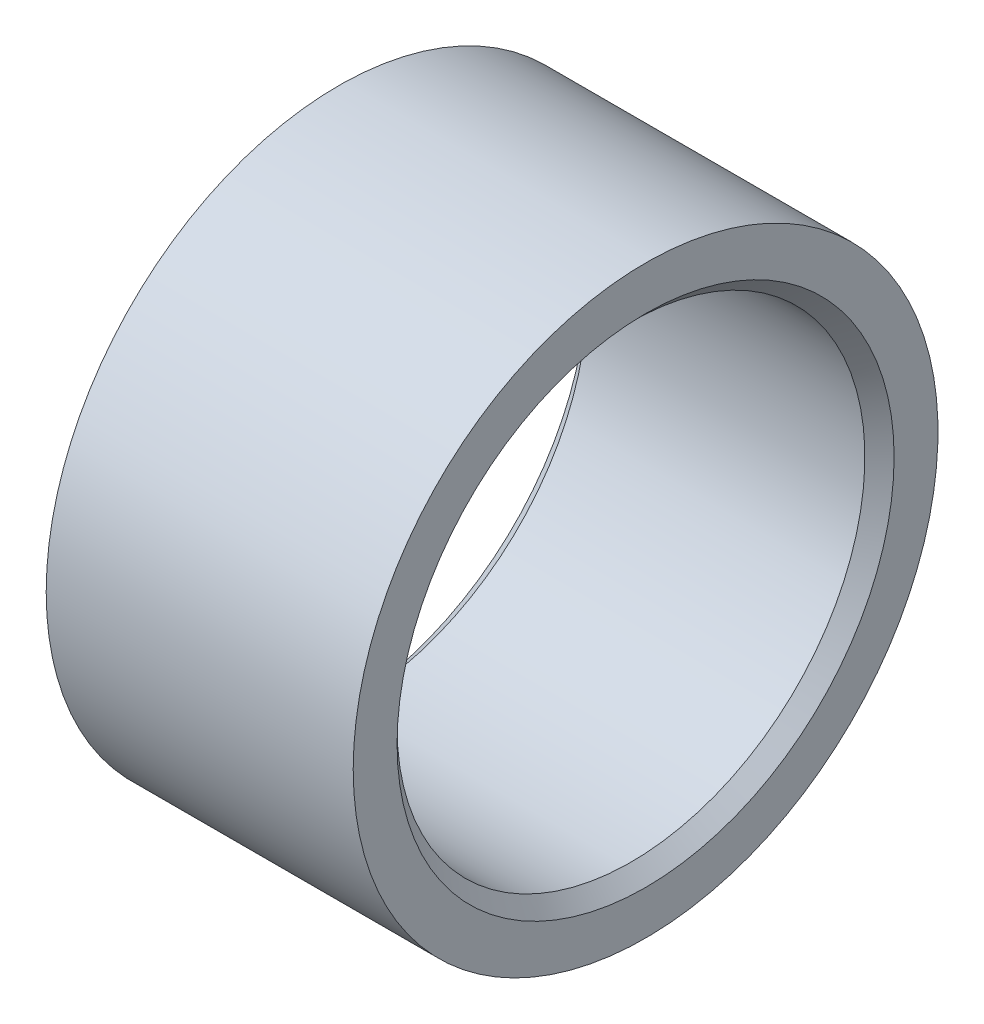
from build123d import *

# Parameters (mm, degrees)
SKETCH_2_W     = 21
SKETCH_2_H     = 4
CHAMFER_1_SIZE = 1


with BuildPart() as part:
    # Sketch 2 → Revolve 4 (revolve)
    with BuildSketch(Plane.XY, mode=Mode.PRIVATE) as revolve_4_sk:
        with Locations((10.5, 18)):
            Rectangle(SKETCH_2_W, SKETCH_2_H)
    revolve(revolve_4_sk.sketch.rotate(Axis((0, 0, 0), (1, 0, 0)), 90), axis=Axis((0, 0, 0), (1, 0, 0)))

    # Chamfer 1
    chamfer_1_edges = [part.edges().sort_by_distance(p)[0] for p in [
        (21, 0, -16),
        (0, 0, -16),
    ]]
    chamfer(chamfer_1_edges, length=CHAMFER_1_SIZE)


solid = part.part
